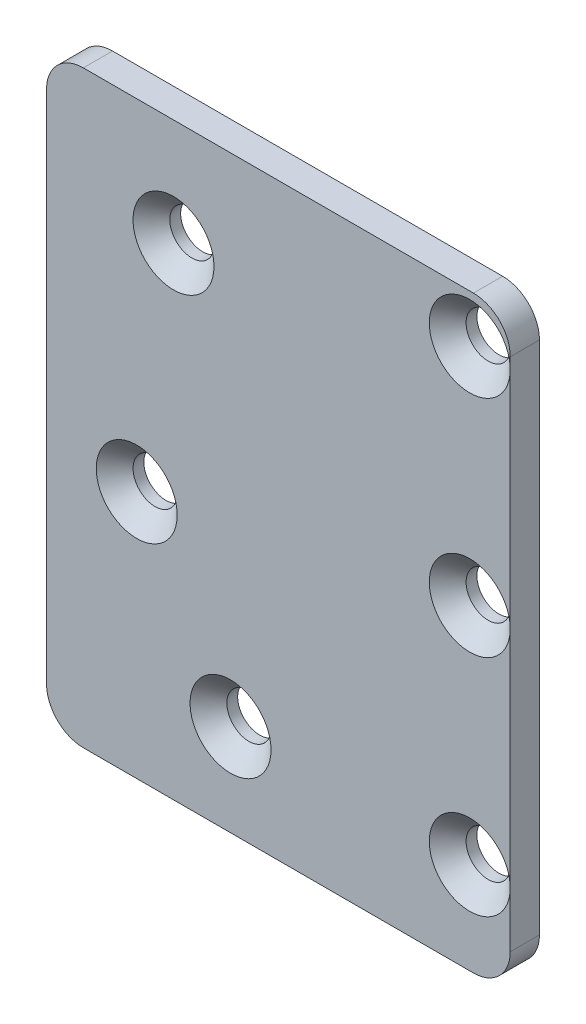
from build123d import *

# Parameters (mm, degrees)
SKETCH1_W                                      = 25.2
SKETCH1_H                                      = 32
BOSS_EXTRUDE1_DEPTH                            = 1.5875
CSK_FOR_M2_FLAT_HEAD_MACHINE_SCREW1_AT_2_COUNT = 2
CSK_FOR_M2_FLAT_HEAD_MACHINE_SCREW1_AT_2_PITCH = 13
CSK_FOR_M2_FLAT_HEAD_MACHINE_SCREW1_AT_3_COUNT = 2
CSK_FOR_M2_FLAT_HEAD_MACHINE_SCREW1_AT_3_PITCH = 17.828067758
CSK_FOR_M2_FLAT_HEAD_MACHINE_SCREW1_AT_4_COUNT = 2
CSK_FOR_M2_FLAT_HEAD_MACHINE_SCREW1_AT_4_PITCH = 27.647061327
CSK_FOR_M2_FLAT_HEAD_MACHINE_SCREW1_AT_5_COUNT = 2
CSK_FOR_M2_FLAT_HEAD_MACHINE_SCREW1_AT_5_PITCH = 9.912618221
CSK_FOR_M2_FLAT_HEAD_MACHINE_SCREW1_AT_6_COUNT = 2
CSK_FOR_M2_FLAT_HEAD_MACHINE_SCREW1_AT_6_PITCH = 21.425452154
CUT_EXTRUDE1_DEPTH                             = 0.5
CUT_EXTRUDE2_DEPTH                             = 0.75
FILLET1_R                                      = 2


with BuildPart() as part:
    # Sketch1 → Boss-Extrude1 (new body)
    with BuildSketch(Plane.XY):
        with Locations((12.6, 16)):
            Rectangle(SKETCH1_W, SKETCH1_H)
    extrude(amount=BOSS_EXTRUDE1_DEPTH)

    # Sketch2 → CSK for M2 Flat Head Machine Screw1 (revolve, cut)
    with BuildSketch(Plane(origin=(10, 5, 1.5875), x_dir=(0, -1, 0), z_dir=(1, 0, 0))):
        Polygon((0, 0), (0, 1.5875), (1.2, 1.5875), (1.2, 1), (2.2, 0), align=None)
    csk_for_m2_flat_head_machine_screw1 = revolve(axis=Axis((10, 5, 7.9375), (0, 0, -1)), mode=Mode.SUBTRACT)

    # CSK for M2 Flat Head Machine Screw1 at 2: CSK for M2 Flat Head Machine Screw1 ×2
    with Locations(*[(i * CSK_FOR_M2_FLAT_HEAD_MACHINE_SCREW1_AT_2_PITCH, 0, 0) for i in range(1, CSK_FOR_M2_FLAT_HEAD_MACHINE_SCREW1_AT_2_COUNT)]):
        add(csk_for_m2_flat_head_machine_screw1, mode=Mode.SUBTRACT)

    # CSK for M2 Flat Head Machine Screw1 at 3: CSK for M2 Flat Head Machine Screw1 ×2
    with Locations(*[Vector(0.7291872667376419, 0.684314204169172, 0) * (i * CSK_FOR_M2_FLAT_HEAD_MACHINE_SCREW1_AT_3_PITCH) for i in range(1, CSK_FOR_M2_FLAT_HEAD_MACHINE_SCREW1_AT_3_COUNT)]):
        add(csk_for_m2_flat_head_machine_screw1, mode=Mode.SUBTRACT)

    # CSK for M2 Flat Head Machine Screw1 at 4: CSK for M2 Flat Head Machine Screw1 ×2
    with Locations(*[Vector(0.4702127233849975, 0.8825531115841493, 0) * (i * CSK_FOR_M2_FLAT_HEAD_MACHINE_SCREW1_AT_4_PITCH) for i in range(1, CSK_FOR_M2_FLAT_HEAD_MACHINE_SCREW1_AT_4_COUNT)]):
        add(csk_for_m2_flat_head_machine_screw1, mode=Mode.SUBTRACT)

    # CSK for M2 Flat Head Machine Screw1 at 5: CSK for M2 Flat Head Machine Screw1 ×2
    with Locations(*[Vector(-0.5144957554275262, 0.8574929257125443, 0) * (i * CSK_FOR_M2_FLAT_HEAD_MACHINE_SCREW1_AT_5_PITCH) for i in range(1, CSK_FOR_M2_FLAT_HEAD_MACHINE_SCREW1_AT_5_COUNT)]):
        add(csk_for_m2_flat_head_machine_screw1, mode=Mode.SUBTRACT)

    # CSK for M2 Flat Head Machine Screw1 at 6: CSK for M2 Flat Head Machine Screw1 ×2
    with Locations(*[Vector(-0.1446877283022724, 0.9894773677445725, 0) * (i * CSK_FOR_M2_FLAT_HEAD_MACHINE_SCREW1_AT_6_PITCH) for i in range(1, CSK_FOR_M2_FLAT_HEAD_MACHINE_SCREW1_AT_6_COUNT)]):
        add(csk_for_m2_flat_head_machine_screw1, mode=Mode.SUBTRACT)

    # Sketch4 → Cut-Extrude1 (cut)
    with BuildSketch(Plane(origin=(0, 0, 0), x_dir=(-1, 0, 0), z_dir=(0, 0, -1))):
        with BuildLine():
            Line((-18.520493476, 16.035759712), (-11.270493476, 24.035759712))
            ThreePointArc((-11.270493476, 24.035759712), (-10.564240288, 24.070493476), (-10.529506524, 23.364240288))
            Line((-10.529506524, 23.364240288), (-17.779506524, 15.364240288))
            ThreePointArc((-17.779506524, 15.364240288), (-18.485759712, 15.329506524), (-18.520493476, 16.035759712))
        make_face()
        with BuildLine():
            Line((-2.030271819, 22.663397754), (-17.780271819, 5.363397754))
            ThreePointArc((-17.780271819, 5.363397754), (-18.486602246, 5.330271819), (-18.519728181, 6.036602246))
            Line((-18.519728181, 6.036602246), (-2.769728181, 23.336602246))
            ThreePointArc((-2.769728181, 23.336602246), (-2.063397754, 23.369728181), (-2.030271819, 22.663397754))
        make_face()
    extrude(amount=-CUT_EXTRUDE1_DEPTH, mode=Mode.SUBTRACT)

    # Sketch5 → Cut-Extrude2 (cut)
    # profile 1 of 2: a face of its own
    with BuildSketch(Plane(origin=(0, 0, 0), x_dir=(-1, 0, 0), z_dir=(0, 0, -1))):
        with BuildLine():
            Line((-19.780171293, 17.177342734), (-12.530171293, 25.177342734))
            ThreePointArc((-12.530171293, 25.177342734), (-9.422657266, 25.330171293), (-9.269828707, 22.222657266))
            Line((-9.269828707, 22.222657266), (-16.519828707, 14.222657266))
            ThreePointArc((-16.519828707, 14.222657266), (-19.627342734, 14.069828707), (-19.780171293, 17.177342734))
        make_face()
        with BuildLine():
            Line((-18.742789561, 16.23721554), (-11.492789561, 24.23721554))
            ThreePointArc((-11.492789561, 24.23721554), (-10.36278446, 24.292789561), (-10.307210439, 23.16278446))
            Line((-10.307210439, 23.16278446), (-17.557210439, 15.16278446))
            ThreePointArc((-17.557210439, 15.16278446), (-18.68721554, 15.107210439), (-18.742789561, 16.23721554))
        make_face(mode=Mode.SUBTRACT)
    # profile 2 of 2: a face of its own
    with BuildSketch(Plane(origin=(0, 0, 0), x_dir=(-1, 0, 0), z_dir=(0, 0, -1))):
        with BuildLine():
            Line((-0.773196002, 21.518950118), (-16.523196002, 4.218950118))
            ThreePointArc((-16.523196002, 4.218950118), (-19.631049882, 4.073196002), (-19.776803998, 7.181049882))
            Line((-19.776803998, 7.181049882), (-4.026803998, 24.481049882))
            ThreePointArc((-4.026803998, 24.481049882), (-0.918950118, 24.626803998), (-0.773196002, 21.518950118))
        make_face()
        with BuildLine():
            Line((-18.74156509, 6.238563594), (-2.99156509, 23.538563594))
            ThreePointArc((-2.99156509, 23.538563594), (-1.861436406, 23.59156509), (-1.80843491, 22.461436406))
            Line((-1.80843491, 22.461436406), (-17.55843491, 5.161436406))
            ThreePointArc((-17.55843491, 5.161436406), (-18.688563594, 5.10843491), (-18.74156509, 6.238563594))
        make_face(mode=Mode.SUBTRACT)
    extrude(amount=-CUT_EXTRUDE2_DEPTH, mode=Mode.SUBTRACT)

    # Fillet1
    fillet1_edges = [part.edges().sort_by_distance(p)[0] for p in [
        (0, 32, 0.79375),
        (25.2, 32, 0.79375),
        (25.2, 0, 0.79375),
        (0, 0, 0.79375),
    ]]
    fillet(fillet1_edges, radius=FILLET1_R)


solid = part.part
